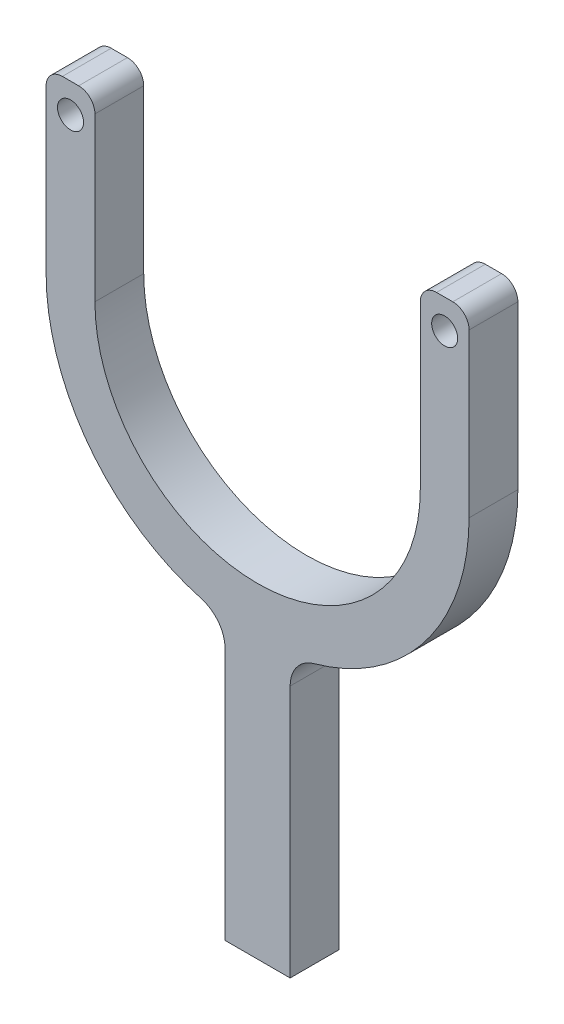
from build123d import *

# Parameters (mm, degrees)
SKETCH1_W           = 20
SKETCH1_H           = 100
EXTRUDE1_DEPTH      = 7.5
EXTRUDE_THIN1_DEPTH = 7.5
FILLET1_R           = 10
SKETCH3_R           = 4
EXTRUDE2_DEPTH      = 130.903810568
FILLET2_R           = 5


with BuildPart() as part:
    # Sketch1 → Extrude1 (new, symmetric)
    with BuildSketch(Plane.XY):
        with Locations((10, -50)):
            Rectangle(SKETCH1_W, SKETCH1_H)
    extrude(amount=EXTRUDE1_DEPTH, both=True)

    # Sketch2 → Extrude-Thin1 (add, symmetric)
    with BuildSketch(Plane.XY):
        with BuildLine():
            Line((60, 105), (60, 50))
            ThreePointArc((60, 50), (10, 0), (-40, 50))
            Line((-40, 50), (-40, 105))
            Line((-40, 105), (-55, 105))
            Line((-55, 105), (-55, 50))
            ThreePointArc((-55, 50), (10, -15), (75, 50))
            Line((75, 50), (75, 105))
            Line((75, 105), (60, 105))
        make_face()
    extrude(amount=EXTRUDE_THIN1_DEPTH, both=True)

    # Fillet1
    fillet1_edges = [part.edges().sort_by_distance(p)[0] for p in [
        (0, -14.226162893, 0),
        (20, -14.226162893, 0),
    ]]
    fillet(fillet1_edges, radius=FILLET1_R)

    # Sketch3 → Extrude2 (cut, through all)
    with BuildSketch(Plane.XY.offset(7.5)):
        with Locations((-47.5, 96)):
            Circle(SKETCH3_R)
        with Locations((67.5, 96)):
            Circle(SKETCH3_R)
    extrude(amount=-EXTRUDE2_DEPTH, mode=Mode.SUBTRACT)

    # Fillet2
    fillet2_edges = [part.edges().sort_by_distance(p)[0] for p in [
        (75, 105, 0),
        (60, 105, 0),
        (-40, 105, 0),
        (-55, 105, 0),
    ]]
    fillet(fillet2_edges, radius=FILLET2_R)


solid = part.part
